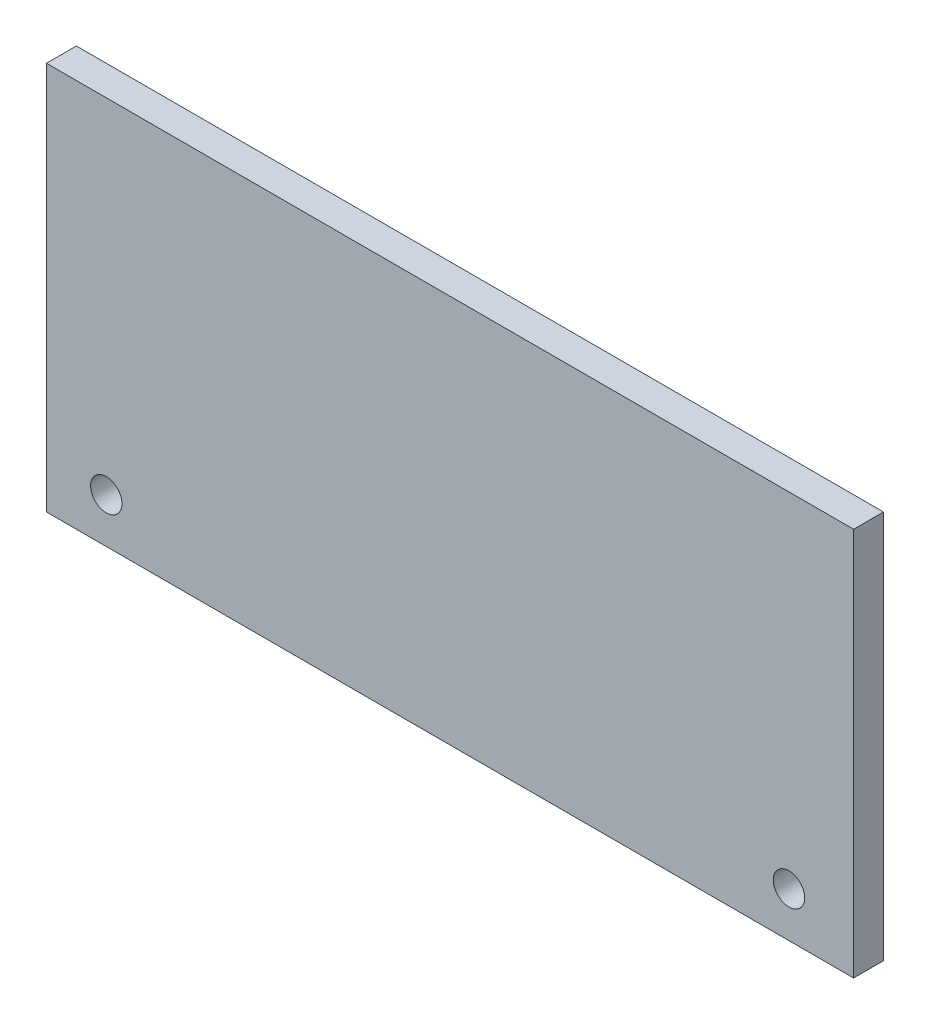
from build123d import *

# Parameters (mm, degrees)
ESQUISSE1_W             = 270
ESQUISSE1_H             = 130
EXTRUSION1_DEPTH        = 10
ESQUISSE2_R             = 5.25
ENL_V_MAT_EXTRU_1_DEPTH = 10


with BuildPart() as part:
    # Esquisse1 → Extrusion1 (new body)
    with BuildSketch(Plane.XY):
        with Locations((135, 65)):
            Rectangle(ESQUISSE1_W, ESQUISSE1_H)
    extrude(amount=-EXTRUSION1_DEPTH)

    # Esquisse2 → Enl_v. mat.-Extru.1 (cut)
    with BuildSketch(Plane.XY):
        with Locations((20, 15)):
            Circle(ESQUISSE2_R)
        with Locations(Location((248.376054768, 15, 0), (0, 0, 180))):
            Circle(ESQUISSE2_R)
    extrude(amount=-ENL_V_MAT_EXTRU_1_DEPTH, mode=Mode.SUBTRACT)


solid = part.part
